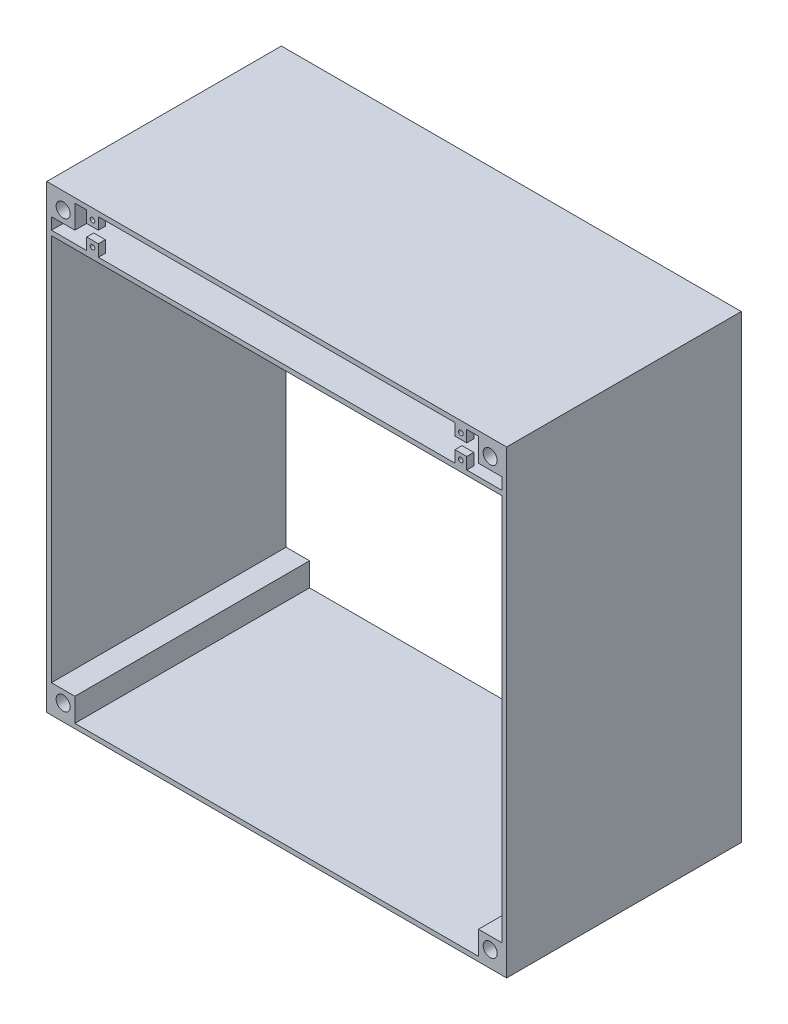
from build123d import *

# Parameters (mm, degrees)
SKETCH1_W           = 248.92
SKETCH1_H           = 248.92
SKETCH1_W_2         = 243.84
SKETCH1_H_2         = 243.84
BOSS_EXTRUDE1_DEPTH = 63.5
SKETCH2_W           = 243.84
SKETCH2_H           = 2.54
EXTRUDE_THIN1_DEPTH = 63.5
SKETCH4_R           = 6.35
CUT_EXTRUDE1_DEPTH  = 2.54
SKETCH5_W           = 6.35
SKETCH5_H           = 6.35
SKETCH5_R           = 1.27
BOSS_EXTRUDE2_DEPTH = 3.81
SKETCH6_W           = 12.7
SKETCH6_H           = 12.7
SKETCH6_R           = 3.81
BOSS_EXTRUDE3_DEPTH = 63.5


with BuildPart() as part:
    # Sketch1 → Boss-Extrude1 (new, symmetric)
    with BuildSketch(Plane.XY):
        with Locations((124.46, 124.46)):
            Rectangle(SKETCH1_W, SKETCH1_H)
        with Locations((124.46, 124.46)):
            Rectangle(SKETCH1_W_2, SKETCH1_H_2, mode=Mode.SUBTRACT)
    extrude(amount=BOSS_EXTRUDE1_DEPTH, both=True)

    # Sketch2 → Extrude-Thin1 (add, symmetric)
    with BuildSketch(Plane.XY):
        with Locations((124.46, 226.06)):
            Rectangle(SKETCH2_W, SKETCH2_H)
    extrude(amount=EXTRUDE_THIN1_DEPTH, both=True)

    # Sketch4 → Cut-Extrude1 (cut)
    with BuildSketch(Plane.XZ.offset(-224.79)):
        with Locations(Location((63.5, 0, 0), (0, 0, 270))):
            Circle(SKETCH4_R)
        with Locations(Location((185.42, 0, 0), (0, 0, 270))):
            Circle(SKETCH4_R)
    extrude(amount=-CUT_EXTRUDE1_DEPTH, mode=Mode.SUBTRACT)

    # Sketch5 → Boss-Extrude2 (add)
    # profile 1 of 4: a face of its own
    with BuildSketch(Plane.XY.offset(63.5)):
        with Locations((24.765, 230.505)):
            Rectangle(SKETCH5_W, SKETCH5_H)
        with Locations((24.765, 230.505)):
            Circle(SKETCH5_R, mode=Mode.SUBTRACT)
    # profile 2 of 4: a face of its own
    with BuildSketch(Plane.XY.offset(63.5)):
        with Locations((224.155, 230.505)):
            Rectangle(SKETCH5_W, SKETCH5_H)
        with Locations((224.155, 230.505)):
            Circle(SKETCH5_R, mode=Mode.SUBTRACT)
    # profile 3 of 4: a face of its own
    with BuildSketch(Plane.XY.offset(63.5)):
        with Locations((24.765, 243.205)):
            Rectangle(SKETCH5_W, SKETCH5_H)
        with Locations((24.765, 243.205)):
            Circle(SKETCH5_R, mode=Mode.SUBTRACT)
    # profile 4 of 4: a face of its own
    with BuildSketch(Plane.XY.offset(63.5)):
        with Locations((224.155, 243.205)):
            Rectangle(SKETCH5_W, SKETCH5_H)
        with Locations((224.155, 243.205)):
            Circle(SKETCH5_R, mode=Mode.SUBTRACT)
    boss_extrude2 = extrude(amount=-BOSS_EXTRUDE2_DEPTH)

    # Mirror1: Boss-Extrude2 across plane
    add(boss_extrude2.mirror(Plane.XY))

    # Sketch6 → Boss-Extrude3 (add, symmetric)
    # profile 1 of 4: a face of its own
    with BuildSketch(Plane.XY):
        with Locations((240.03, 240.03)):
            Rectangle(SKETCH6_W, SKETCH6_H)
        with Locations((240.03, 240.03)):
            Circle(SKETCH6_R, mode=Mode.SUBTRACT)
    # profile 2 of 4: a face of its own
    with BuildSketch(Plane.XY):
        with Locations((8.89, 8.89)):
            Rectangle(SKETCH6_W, SKETCH6_H)
        with Locations((8.89, 8.89)):
            Circle(SKETCH6_R, mode=Mode.SUBTRACT)
    # profile 3 of 4: a face of its own
    with BuildSketch(Plane.XY):
        with Locations((240.03, 8.89)):
            Rectangle(SKETCH6_W, SKETCH6_H)
        with Locations((240.03, 8.89)):
            Circle(SKETCH6_R, mode=Mode.SUBTRACT)
    # profile 4 of 4: a face of its own
    with BuildSketch(Plane.XY):
        with Locations((8.89, 240.03)):
            Rectangle(SKETCH6_W, SKETCH6_H)
        with Locations((8.89, 240.03)):
            Circle(SKETCH6_R, mode=Mode.SUBTRACT)
    extrude(amount=BOSS_EXTRUDE3_DEPTH, both=True)


solid = part.part
